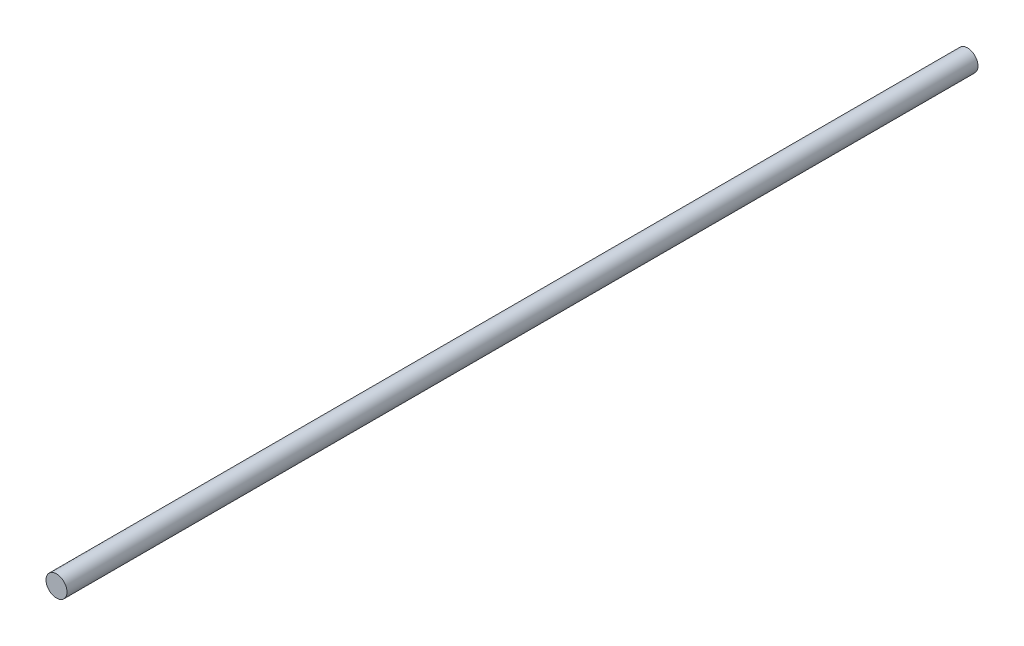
from build123d import *

# Parameters (mm, degrees)
SKETCH1_R           = 30
BOSS_EXTRUDE1_DEPTH = 2600


with BuildPart() as part:
    # Sketch1 → Boss-Extrude1 (new body)
    with BuildSketch(Plane.XY):
        Circle(SKETCH1_R)
    extrude(amount=-BOSS_EXTRUDE1_DEPTH)


solid = part.part
